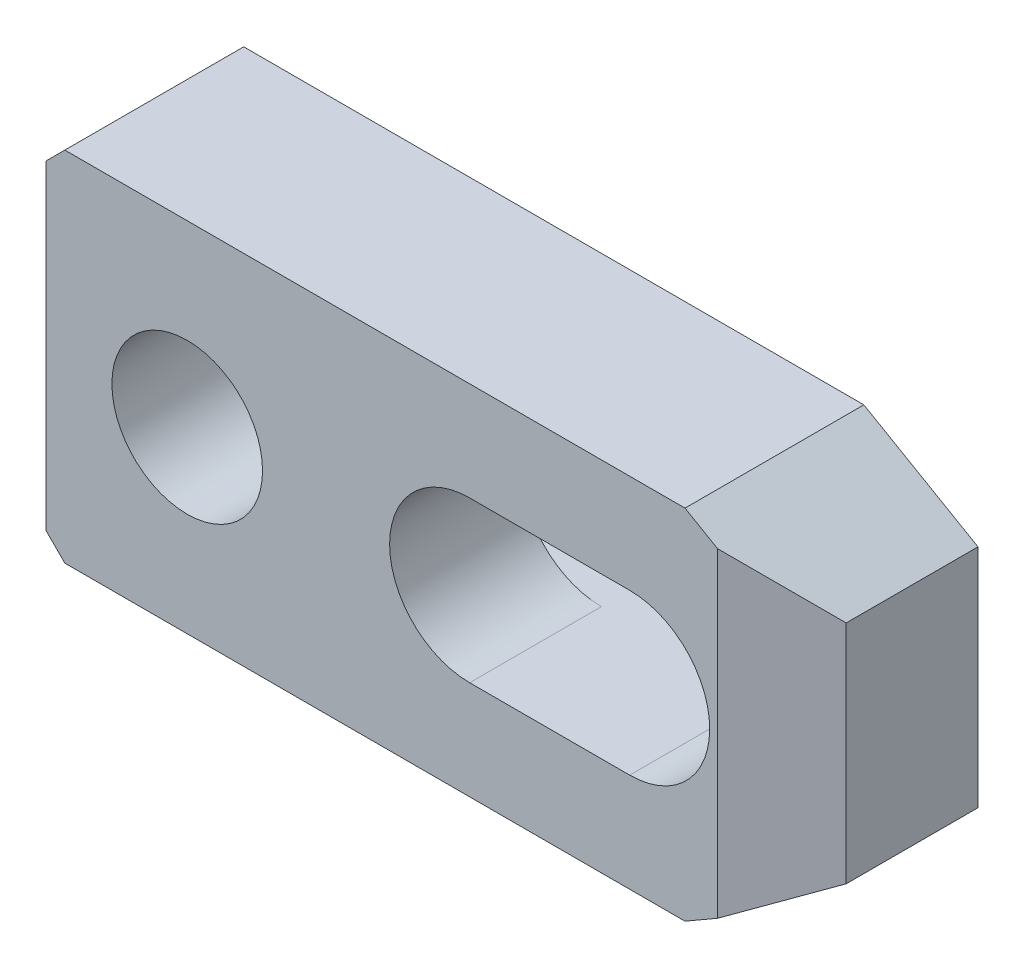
ISO-10303-21;
HEADER;
FILE_DESCRIPTION(('STEP AP214'),'2;1');
FILE_NAME('part.step','',(''),(''),'','','');
FILE_SCHEMA(('AUTOMOTIVE_DESIGN { 1 0 10303 214 1 1 1 1 }'));
ENDSEC;
DATA;
#1=APPLICATION_CONTEXT('core data for automotive mechanical design processes');
#2=APPLICATION_PROTOCOL_DEFINITION('international standard','automotive_design',2000,#1);
#3=PRODUCT_CONTEXT('',#1,'mechanical');
#4=PRODUCT('Part','Part','',(#3));
#5=PRODUCT_RELATED_PRODUCT_CATEGORY('part','',(#4));
#6=PRODUCT_DEFINITION_FORMATION('','',#4);
#7=PRODUCT_DEFINITION_CONTEXT('part definition',#1,'design');
#8=PRODUCT_DEFINITION('design','',#6,#7);
#9=PRODUCT_DEFINITION_SHAPE('','',#8);
#10=(LENGTH_UNIT() NAMED_UNIT(*) SI_UNIT(.MILLI.,.METRE.));
#11=(NAMED_UNIT(*) PLANE_ANGLE_UNIT() SI_UNIT($,.RADIAN.));
#12=(NAMED_UNIT(*) SI_UNIT($,.STERADIAN.) SOLID_ANGLE_UNIT());
#13=UNCERTAINTY_MEASURE_WITH_UNIT(LENGTH_MEASURE(1.E-05),#10,'distance_accuracy_value','');
#14=(GEOMETRIC_REPRESENTATION_CONTEXT(3) GLOBAL_UNCERTAINTY_ASSIGNED_CONTEXT((#13)) GLOBAL_UNIT_ASSIGNED_CONTEXT((#10,
#11,#12)) REPRESENTATION_CONTEXT('',''));
#15=CARTESIAN_POINT('',(0.,0.,0.));
#16=DIRECTION('',(0.,0.,1.));
#17=DIRECTION('',(1.,0.,0.));
#18=AXIS2_PLACEMENT_3D('',#15,#16,#17);
#19=CARTESIAN_POINT('',(-35.8878406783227,43.1121593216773,0.));
#20=DIRECTION('',(0.,0.,1.));
#21=DIRECTION('',(-1.,0.,0.));
#22=AXIS2_PLACEMENT_3D('',#19,#20,#21);
#23=PLANE('',#22);
#24=DIRECTION('',(0.,1.,0.));
#25=VECTOR('',#24,1.);
#26=CARTESIAN_POINT('',(-62.,-17.0000000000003,0.));
#27=LINE('',#26,#25);
#28=CARTESIAN_POINT('',(-62.,-17.0000000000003,0.));
#29=VERTEX_POINT('',#28);
#30=CARTESIAN_POINT('',(-62.,-8.50000000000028,0.));
#31=VERTEX_POINT('',#30);
#32=EDGE_CURVE('E147',#29,#31,#27,.T.);
#33=ORIENTED_EDGE('',*,*,#32,.T.);
#34=DIRECTION('',(-1.,0.,0.));
#35=VECTOR('',#34,1.);
#36=CARTESIAN_POINT('',(0.,-8.49999999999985,0.));
#37=LINE('',#36,#35);
#38=CARTESIAN_POINT('',(0.,-8.49999999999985,0.));
#39=VERTEX_POINT('',#38);
#40=EDGE_CURVE('E237',#39,#31,#37,.T.);
#41=ORIENTED_EDGE('',*,*,#40,.F.);
#42=CARTESIAN_POINT('',(0.,1.53625267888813E-13,0.));
#43=DIRECTION('',(0.,0.,1.));
#44=DIRECTION('',(-1.,0.,0.));
#45=AXIS2_PLACEMENT_3D('',#42,#43,#44);
#46=CIRCLE('',#45,8.5);
#47=CARTESIAN_POINT('',(0.,8.50000000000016,0.));
#48=VERTEX_POINT('',#47);
#49=EDGE_CURVE('E128',#39,#48,#46,.T.);
#50=ORIENTED_EDGE('',*,*,#49,.T.);
#51=DIRECTION('',(1.,0.,0.));
#52=VECTOR('',#51,1.);
#53=CARTESIAN_POINT('',(-17.,8.5,0.));
#54=LINE('',#53,#52);
#55=CARTESIAN_POINT('',(-62.,8.49999999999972,0.));
#56=VERTEX_POINT('',#55);
#57=EDGE_CURVE('E119',#56,#48,#54,.T.);
#58=ORIENTED_EDGE('',*,*,#57,.F.);
#59=CARTESIAN_POINT('',(-62.,16.9999999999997,0.));
#60=VERTEX_POINT('',#59);
#61=EDGE_CURVE('E124',#56,#60,#27,.T.);
#62=ORIENTED_EDGE('',*,*,#61,.T.);
#63=DIRECTION('',(-0.707106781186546,-0.70710678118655,0.));
#64=VECTOR('',#63,1.);
#65=CARTESIAN_POINT('',(-60.,18.9999999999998,0.));
#66=LINE('',#65,#64);
#67=CARTESIAN_POINT('',(-60.,18.9999999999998,0.));
#68=VERTEX_POINT('',#67);
#69=EDGE_CURVE('E148',#68,#60,#66,.T.);
#70=ORIENTED_EDGE('',*,*,#69,.F.);
#71=DIRECTION('',(-1.,0.,0.));
#72=VECTOR('',#71,1.);
#73=CARTESIAN_POINT('',(5.8756443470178,19.,0.));
#74=LINE('',#73,#72);
#75=CARTESIAN_POINT('',(5.8756443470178,19.,0.));
#76=VERTEX_POINT('',#75);
#77=EDGE_CURVE('E151',#76,#68,#74,.T.);
#78=ORIENTED_EDGE('',*,*,#77,.F.);
#79=DIRECTION('',(-0.866025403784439,0.499999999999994,0.));
#80=VECTOR('',#79,1.);
#81=CARTESIAN_POINT('',(18.,12.0000000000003,0.));
#82=LINE('',#81,#80);
#83=CARTESIAN_POINT('',(18.,12.0000000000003,0.));
#84=VERTEX_POINT('',#83);
#85=EDGE_CURVE('E158',#84,#76,#82,.T.);
#86=ORIENTED_EDGE('',*,*,#85,.F.);
#87=DIRECTION('',(0.,-1.,0.));
#88=VECTOR('',#87,1.);
#89=CARTESIAN_POINT('',(18.,12.0000000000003,0.));
#90=LINE('',#89,#88);
#91=CARTESIAN_POINT('',(18.,-11.9999999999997,0.));
#92=VERTEX_POINT('',#91);
#93=EDGE_CURVE('E181',#84,#92,#90,.T.);
#94=ORIENTED_EDGE('',*,*,#93,.T.);
#95=DIRECTION('',(-0.866025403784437,-0.500000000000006,0.));
#96=VECTOR('',#95,1.);
#97=CARTESIAN_POINT('',(18.,-11.9999999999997,0.));
#98=LINE('',#97,#96);
#99=CARTESIAN_POINT('',(5.87564434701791,-19.,0.));
#100=VERTEX_POINT('',#99);
#101=EDGE_CURVE('E208',#92,#100,#98,.T.);
#102=ORIENTED_EDGE('',*,*,#101,.T.);
#103=DIRECTION('',(-1.,0.,0.));
#104=VECTOR('',#103,1.);
#105=CARTESIAN_POINT('',(5.87564434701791,-19.,0.));
#106=LINE('',#105,#104);
#107=CARTESIAN_POINT('',(-60.,-19.0000000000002,0.));
#108=VERTEX_POINT('',#107);
#109=EDGE_CURVE('E210',#100,#108,#106,.T.);
#110=ORIENTED_EDGE('',*,*,#109,.T.);
#111=DIRECTION('',(-0.707106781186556,0.707106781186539,0.));
#112=VECTOR('',#111,1.);
#113=CARTESIAN_POINT('',(-60.,-19.0000000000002,0.));
#114=LINE('',#113,#112);
#115=EDGE_CURVE('E150',#108,#29,#114,.T.);
#116=ORIENTED_EDGE('',*,*,#115,.T.);
#117=EDGE_LOOP('',(#33,#41,#50,#58,#62,#70,#78,#86,#94,#102,#110,#116));
#118=FACE_BOUND('',#117,.T.);
#119=ADVANCED_FACE('F14',(#118),#23,.F.);
#120=CARTESIAN_POINT('',(-62.,-17.0000000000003,19.));
#121=DIRECTION('',(-1.,0.,0.));
#122=DIRECTION('',(0.,0.,-1.));
#123=AXIS2_PLACEMENT_3D('',#120,#121,#122);
#124=PLANE('',#123);
#125=DIRECTION('',(0.,-1.,0.));
#126=VECTOR('',#125,1.);
#127=CARTESIAN_POINT('',(-62.,-17.0000000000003,5.));
#128=LINE('',#127,#126);
#129=CARTESIAN_POINT('',(-62.,8.49999999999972,5.));
#130=VERTEX_POINT('',#129);
#131=CARTESIAN_POINT('',(-62.,-8.50000000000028,5.));
#132=VERTEX_POINT('',#131);
#133=EDGE_CURVE('E141',#130,#132,#128,.T.);
#134=ORIENTED_EDGE('',*,*,#133,.T.);
#135=DIRECTION('',(0.,0.,-1.));
#136=VECTOR('',#135,1.);
#137=CARTESIAN_POINT('',(-62.,-8.50000000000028,19.));
#138=LINE('',#137,#136);
#139=EDGE_CURVE('E140',#132,#31,#138,.T.);
#140=ORIENTED_EDGE('',*,*,#139,.T.);
#141=ORIENTED_EDGE('',*,*,#32,.F.);
#142=DIRECTION('',(0.,0.,-1.));
#143=VECTOR('',#142,1.);
#144=CARTESIAN_POINT('',(-62.,-17.0000000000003,19.));
#145=LINE('',#144,#143);
#146=CARTESIAN_POINT('',(-62.,-17.0000000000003,19.));
#147=VERTEX_POINT('',#146);
#148=EDGE_CURVE('E189',#147,#29,#145,.T.);
#149=ORIENTED_EDGE('',*,*,#148,.F.);
#150=DIRECTION('',(0.,1.,0.));
#151=VECTOR('',#150,1.);
#152=CARTESIAN_POINT('',(-62.,-17.0000000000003,19.));
#153=LINE('',#152,#151);
#154=CARTESIAN_POINT('',(-62.,16.9999999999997,19.));
#155=VERTEX_POINT('',#154);
#156=EDGE_CURVE('E171',#147,#155,#153,.T.);
#157=ORIENTED_EDGE('',*,*,#156,.T.);
#158=DIRECTION('',(0.,0.,-1.));
#159=VECTOR('',#158,1.);
#160=CARTESIAN_POINT('',(-62.,16.9999999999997,19.));
#161=LINE('',#160,#159);
#162=EDGE_CURVE('E145',#155,#60,#161,.T.);
#163=ORIENTED_EDGE('',*,*,#162,.T.);
#164=ORIENTED_EDGE('',*,*,#61,.F.);
#165=DIRECTION('',(0.,0.,-1.));
#166=VECTOR('',#165,1.);
#167=CARTESIAN_POINT('',(-62.,8.49999999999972,19.));
#168=LINE('',#167,#166);
#169=EDGE_CURVE('E135',#130,#56,#168,.T.);
#170=ORIENTED_EDGE('',*,*,#169,.F.);
#171=EDGE_LOOP('',(#134,#140,#141,#149,#157,#163,#164,#170));
#172=FACE_BOUND('',#171,.T.);
#173=ADVANCED_FACE('F143',(#172),#124,.T.);
#174=CARTESIAN_POINT('',(-47.,-1.68451949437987E-13,19.));
#175=DIRECTION('',(0.,0.,-1.));
#176=DIRECTION('',(1.,0.,0.));
#177=AXIS2_PLACEMENT_3D('',#174,#175,#176);
#178=CYLINDRICAL_SURFACE('',#177,8.);
#179=CARTESIAN_POINT('',(-47.,-1.68451949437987E-13,19.));
#180=DIRECTION('',(0.,0.,1.));
#181=DIRECTION('',(-1.,0.,0.));
#182=AXIS2_PLACEMENT_3D('',#179,#180,#181);
#183=CIRCLE('',#182,8.);
#184=CARTESIAN_POINT('',(-55.,-2.24315683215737E-13,19.));
#185=VERTEX_POINT('',#184);
#186=EDGE_CURVE('E161',#185,#185,#183,.T.);
#187=ORIENTED_EDGE('',*,*,#186,.T.);
#188=EDGE_LOOP('',(#187));
#189=FACE_BOUND('',#188,.T.);
#190=CARTESIAN_POINT('',(-47.,-1.68451949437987E-13,5.));
#191=DIRECTION('',(0.,0.,-1.));
#192=DIRECTION('',(1.,0.,0.));
#193=AXIS2_PLACEMENT_3D('',#190,#191,#192);
#194=CIRCLE('',#193,8.);
#195=CARTESIAN_POINT('',(-39.,-1.12588215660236E-13,5.));
#196=VERTEX_POINT('',#195);
#197=EDGE_CURVE('E400',#196,#196,#194,.T.);
#198=ORIENTED_EDGE('',*,*,#197,.T.);
#199=EDGE_LOOP('',(#198));
#200=FACE_BOUND('',#199,.T.);
#201=ADVANCED_FACE('F262',(#189,#200),#178,.F.);
#202=CARTESIAN_POINT('',(-17.,0.,19.));
#203=DIRECTION('',(0.,0.,-1.));
#204=DIRECTION('',(1.,0.,0.));
#205=AXIS2_PLACEMENT_3D('',#202,#203,#204);
#206=CYLINDRICAL_SURFACE('',#205,8.5);
#207=DIRECTION('',(0.,0.,-1.));
#208=VECTOR('',#207,1.);
#209=CARTESIAN_POINT('',(-17.,-8.5,19.));
#210=LINE('',#209,#208);
#211=CARTESIAN_POINT('',(-17.,-8.5,19.));
#212=VERTEX_POINT('',#211);
#213=CARTESIAN_POINT('',(-17.,-8.5,5.));
#214=VERTEX_POINT('',#213);
#215=EDGE_CURVE('E256',#212,#214,#210,.T.);
#216=ORIENTED_EDGE('',*,*,#215,.T.);
#217=CARTESIAN_POINT('',(-17.,0.,5.));
#218=DIRECTION('',(0.,0.,-1.));
#219=DIRECTION('',(1.,0.,0.));
#220=AXIS2_PLACEMENT_3D('',#217,#218,#219);
#221=CIRCLE('',#220,8.5);
#222=CARTESIAN_POINT('',(-17.,8.5,5.));
#223=VERTEX_POINT('',#222);
#224=EDGE_CURVE('E278',#214,#223,#221,.T.);
#225=ORIENTED_EDGE('',*,*,#224,.T.);
#226=DIRECTION('',(0.,0.,-1.));
#227=VECTOR('',#226,1.);
#228=CARTESIAN_POINT('',(-17.,8.5,19.));
#229=LINE('',#228,#227);
#230=CARTESIAN_POINT('',(-17.,8.5,19.));
#231=VERTEX_POINT('',#230);
#232=EDGE_CURVE('E244',#231,#223,#229,.T.);
#233=ORIENTED_EDGE('',*,*,#232,.F.);
#234=CARTESIAN_POINT('',(-17.,0.,19.));
#235=DIRECTION('',(0.,0.,1.));
#236=DIRECTION('',(-1.,0.,0.));
#237=AXIS2_PLACEMENT_3D('',#234,#235,#236);
#238=CIRCLE('',#237,8.5);
#239=EDGE_CURVE('E132',#231,#212,#238,.T.);
#240=ORIENTED_EDGE('',*,*,#239,.T.);
#241=EDGE_LOOP('',(#216,#225,#233,#240));
#242=FACE_BOUND('',#241,.T.);
#243=ADVANCED_FACE('F269',(#242),#206,.F.);
#244=CARTESIAN_POINT('',(-35.8878406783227,43.1121593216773,19.));
#245=DIRECTION('',(0.,0.,1.));
#246=DIRECTION('',(-1.,0.,0.));
#247=AXIS2_PLACEMENT_3D('',#244,#245,#246);
#248=PLANE('',#247);
#249=DIRECTION('',(0.,-1.,0.));
#250=VECTOR('',#249,1.);
#251=CARTESIAN_POINT('',(9.3397459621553,43.1121593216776,19.));
#252=LINE('',#251,#250);
#253=CARTESIAN_POINT('',(9.3397459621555,17.,19.));
#254=VERTEX_POINT('',#253);
#255=CARTESIAN_POINT('',(9.3397459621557,-17.,19.));
#256=VERTEX_POINT('',#255);
#257=EDGE_CURVE('E233',#254,#256,#252,.T.);
#258=ORIENTED_EDGE('',*,*,#257,.F.);
#259=DIRECTION('',(-0.866025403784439,0.499999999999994,0.));
#260=VECTOR('',#259,1.);
#261=CARTESIAN_POINT('',(18.,12.0000000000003,19.));
#262=LINE('',#261,#260);
#263=CARTESIAN_POINT('',(5.8756443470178,19.,19.));
#264=VERTEX_POINT('',#263);
#265=EDGE_CURVE('E179',#254,#264,#262,.T.);
#266=ORIENTED_EDGE('',*,*,#265,.T.);
#267=DIRECTION('',(-1.,0.,0.));
#268=VECTOR('',#267,1.);
#269=CARTESIAN_POINT('',(5.8756443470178,19.,19.));
#270=LINE('',#269,#268);
#271=CARTESIAN_POINT('',(-60.,18.9999999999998,19.));
#272=VERTEX_POINT('',#271);
#273=EDGE_CURVE('E176',#264,#272,#270,.T.);
#274=ORIENTED_EDGE('',*,*,#273,.T.);
#275=DIRECTION('',(-0.707106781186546,-0.70710678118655,0.));
#276=VECTOR('',#275,1.);
#277=CARTESIAN_POINT('',(-60.,18.9999999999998,19.));
#278=LINE('',#277,#276);
#279=EDGE_CURVE('E173',#272,#155,#278,.T.);
#280=ORIENTED_EDGE('',*,*,#279,.T.);
#281=ORIENTED_EDGE('',*,*,#156,.F.);
#282=DIRECTION('',(-0.707106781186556,0.707106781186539,0.));
#283=VECTOR('',#282,1.);
#284=CARTESIAN_POINT('',(-60.,-19.0000000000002,19.));
#285=LINE('',#284,#283);
#286=CARTESIAN_POINT('',(-60.,-19.0000000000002,19.));
#287=VERTEX_POINT('',#286);
#288=EDGE_CURVE('E168',#287,#147,#285,.T.);
#289=ORIENTED_EDGE('',*,*,#288,.F.);
#290=DIRECTION('',(-1.,0.,0.));
#291=VECTOR('',#290,1.);
#292=CARTESIAN_POINT('',(5.87564434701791,-19.,19.));
#293=LINE('',#292,#291);
#294=CARTESIAN_POINT('',(5.87564434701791,-19.,19.));
#295=VERTEX_POINT('',#294);
#296=EDGE_CURVE('E165',#295,#287,#293,.T.);
#297=ORIENTED_EDGE('',*,*,#296,.F.);
#298=DIRECTION('',(-0.866025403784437,-0.500000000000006,0.));
#299=VECTOR('',#298,1.);
#300=CARTESIAN_POINT('',(18.,-11.9999999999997,19.));
#301=LINE('',#300,#299);
#302=EDGE_CURVE('E162',#256,#295,#301,.T.);
#303=ORIENTED_EDGE('',*,*,#302,.F.);
#304=EDGE_LOOP('',(#258,#266,#274,#280,#281,#289,#297,#303));
#305=FACE_BOUND('',#304,.T.);
#306=ORIENTED_EDGE('',*,*,#186,.F.);
#307=EDGE_LOOP('',(#306));
#308=FACE_BOUND('',#307,.T.);
#309=DIRECTION('',(-1.,0.,0.));
#310=VECTOR('',#309,1.);
#311=CARTESIAN_POINT('',(0.,-8.49999999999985,19.));
#312=LINE('',#311,#310);
#313=CARTESIAN_POINT('',(0.,-8.49999999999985,19.));
#314=VERTEX_POINT('',#313);
#315=EDGE_CURVE('E247',#314,#212,#312,.T.);
#316=ORIENTED_EDGE('',*,*,#315,.T.);
#317=ORIENTED_EDGE('',*,*,#239,.F.);
#318=DIRECTION('',(1.,0.,0.));
#319=VECTOR('',#318,1.);
#320=CARTESIAN_POINT('',(-17.,8.5,19.));
#321=LINE('',#320,#319);
#322=CARTESIAN_POINT('',(0.,8.50000000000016,19.));
#323=VERTEX_POINT('',#322);
#324=EDGE_CURVE('E241',#231,#323,#321,.T.);
#325=ORIENTED_EDGE('',*,*,#324,.T.);
#326=CARTESIAN_POINT('',(0.,1.53625267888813E-13,19.));
#327=DIRECTION('',(0.,0.,1.));
#328=DIRECTION('',(-1.,0.,0.));
#329=AXIS2_PLACEMENT_3D('',#326,#327,#328);
#330=CIRCLE('',#329,8.5);
#331=EDGE_CURVE('E245',#314,#323,#330,.T.);
#332=ORIENTED_EDGE('',*,*,#331,.F.);
#333=EDGE_LOOP('',(#316,#317,#325,#332));
#334=FACE_BOUND('',#333,.T.);
#335=ADVANCED_FACE('F265',(#305,#308,#334),#248,.T.);
#336=CARTESIAN_POINT('',(18.,12.0000000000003,19.));
#337=DIRECTION('',(-0.499999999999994,-0.866025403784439,0.));
#338=DIRECTION('',(0.86602540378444,-0.499999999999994,0.));
#339=AXIS2_PLACEMENT_3D('',#336,#337,#338);
#340=PLANE('',#339);
#341=ORIENTED_EDGE('',*,*,#265,.F.);
#342=DIRECTION('',(0.774596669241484,-0.447213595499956,-0.447213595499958));
#343=VECTOR('',#342,1.);
#344=CARTESIAN_POINT('',(16.267949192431,13.0000000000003,15.));
#345=LINE('',#344,#343);
#346=CARTESIAN_POINT('',(18.,12.0000000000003,14.));
#347=VERTEX_POINT('',#346);
#348=EDGE_CURVE('E235',#254,#347,#345,.T.);
#349=ORIENTED_EDGE('',*,*,#348,.T.);
#350=DIRECTION('',(0.,0.,-1.));
#351=VECTOR('',#350,1.);
#352=CARTESIAN_POINT('',(18.,12.0000000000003,19.));
#353=LINE('',#352,#351);
#354=EDGE_CURVE('E164',#347,#84,#353,.T.);
#355=ORIENTED_EDGE('',*,*,#354,.T.);
#356=ORIENTED_EDGE('',*,*,#85,.T.);
#357=DIRECTION('',(0.,0.,-1.));
#358=VECTOR('',#357,1.);
#359=CARTESIAN_POINT('',(5.8756443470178,19.,19.));
#360=LINE('',#359,#358);
#361=EDGE_CURVE('E9',#264,#76,#360,.T.);
#362=ORIENTED_EDGE('',*,*,#361,.F.);
#363=EDGE_LOOP('',(#341,#349,#355,#356,#362));
#364=FACE_BOUND('',#363,.T.);
#365=ADVANCED_FACE('F268',(#364),#340,.F.);
#366=CARTESIAN_POINT('',(5.8756443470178,19.,19.));
#367=DIRECTION('',(0.,-1.,0.));
#368=DIRECTION('',(0.,0.,1.));
#369=AXIS2_PLACEMENT_3D('',#366,#367,#368);
#370=PLANE('',#369);
#371=DIRECTION('',(0.,0.,-1.));
#372=VECTOR('',#371,1.);
#373=CARTESIAN_POINT('',(-60.,18.9999999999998,19.));
#374=LINE('',#373,#372);
#375=EDGE_CURVE('E22',#272,#68,#374,.T.);
#376=ORIENTED_EDGE('',*,*,#375,.F.);
#377=ORIENTED_EDGE('',*,*,#273,.F.);
#378=ORIENTED_EDGE('',*,*,#361,.T.);
#379=ORIENTED_EDGE('',*,*,#77,.T.);
#380=EDGE_LOOP('',(#376,#377,#378,#379));
#381=FACE_BOUND('',#380,.T.);
#382=ADVANCED_FACE('F16',(#381),#370,.F.);
#383=CARTESIAN_POINT('',(-60.,18.9999999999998,19.));
#384=DIRECTION('',(0.70710678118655,-0.707106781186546,0.));
#385=DIRECTION('',(0.707106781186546,0.70710678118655,0.));
#386=AXIS2_PLACEMENT_3D('',#383,#384,#385);
#387=PLANE('',#386);
#388=ORIENTED_EDGE('',*,*,#162,.F.);
#389=ORIENTED_EDGE('',*,*,#279,.F.);
#390=ORIENTED_EDGE('',*,*,#375,.T.);
#391=ORIENTED_EDGE('',*,*,#69,.T.);
#392=EDGE_LOOP('',(#388,#389,#390,#391));
#393=FACE_BOUND('',#392,.T.);
#394=ADVANCED_FACE('F193',(#393),#387,.F.);
#395=CARTESIAN_POINT('',(-60.,-19.0000000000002,19.));
#396=DIRECTION('',(-0.707106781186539,-0.707106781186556,0.));
#397=DIRECTION('',(0.707106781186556,-0.707106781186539,0.));
#398=AXIS2_PLACEMENT_3D('',#395,#396,#397);
#399=PLANE('',#398);
#400=DIRECTION('',(0.,0.,-1.));
#401=VECTOR('',#400,1.);
#402=CARTESIAN_POINT('',(-60.,-19.0000000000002,19.));
#403=LINE('',#402,#401);
#404=EDGE_CURVE('E187',#287,#108,#403,.T.);
#405=ORIENTED_EDGE('',*,*,#404,.F.);
#406=ORIENTED_EDGE('',*,*,#288,.T.);
#407=ORIENTED_EDGE('',*,*,#148,.T.);
#408=ORIENTED_EDGE('',*,*,#115,.F.);
#409=EDGE_LOOP('',(#405,#406,#407,#408));
#410=FACE_BOUND('',#409,.T.);
#411=ADVANCED_FACE('F220',(#410),#399,.T.);
#412=CARTESIAN_POINT('',(5.87564434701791,-19.,19.));
#413=DIRECTION('',(0.,-1.,0.));
#414=DIRECTION('',(0.,0.,1.));
#415=AXIS2_PLACEMENT_3D('',#412,#413,#414);
#416=PLANE('',#415);
#417=DIRECTION('',(0.,0.,-1.));
#418=VECTOR('',#417,1.);
#419=CARTESIAN_POINT('',(5.87564434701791,-19.,19.));
#420=LINE('',#419,#418);
#421=EDGE_CURVE('E185',#295,#100,#420,.T.);
#422=ORIENTED_EDGE('',*,*,#421,.F.);
#423=ORIENTED_EDGE('',*,*,#296,.T.);
#424=ORIENTED_EDGE('',*,*,#404,.T.);
#425=ORIENTED_EDGE('',*,*,#109,.F.);
#426=EDGE_LOOP('',(#422,#423,#424,#425));
#427=FACE_BOUND('',#426,.T.);
#428=ADVANCED_FACE('F308',(#427),#416,.T.);
#429=CARTESIAN_POINT('',(18.,-11.9999999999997,19.));
#430=DIRECTION('',(0.500000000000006,-0.866025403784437,0.));
#431=DIRECTION('',(0.866025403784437,0.500000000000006,0.));
#432=AXIS2_PLACEMENT_3D('',#429,#430,#431);
#433=PLANE('',#432);
#434=DIRECTION('',(0.774596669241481,0.447213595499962,-0.44721359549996));
#435=VECTOR('',#434,1.);
#436=CARTESIAN_POINT('',(16.2679491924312,-12.9999999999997,15.));
#437=LINE('',#436,#435);
#438=CARTESIAN_POINT('',(18.,-11.9999999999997,14.));
#439=VERTEX_POINT('',#438);
#440=EDGE_CURVE('E37',#256,#439,#437,.T.);
#441=ORIENTED_EDGE('',*,*,#440,.F.);
#442=ORIENTED_EDGE('',*,*,#302,.T.);
#443=ORIENTED_EDGE('',*,*,#421,.T.);
#444=ORIENTED_EDGE('',*,*,#101,.F.);
#445=DIRECTION('',(0.,0.,-1.));
#446=VECTOR('',#445,1.);
#447=CARTESIAN_POINT('',(18.,-11.9999999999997,19.));
#448=LINE('',#447,#446);
#449=EDGE_CURVE('E183',#439,#92,#448,.T.);
#450=ORIENTED_EDGE('',*,*,#449,.F.);
#451=EDGE_LOOP('',(#441,#442,#443,#444,#450));
#452=FACE_BOUND('',#451,.T.);
#453=ADVANCED_FACE('F305',(#452),#433,.T.);
#454=CARTESIAN_POINT('',(18.,12.0000000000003,19.));
#455=DIRECTION('',(1.,0.,0.));
#456=DIRECTION('',(0.,0.,1.));
#457=AXIS2_PLACEMENT_3D('',#454,#455,#456);
#458=PLANE('',#457);
#459=DIRECTION('',(0.,-1.,0.));
#460=VECTOR('',#459,1.);
#461=CARTESIAN_POINT('',(18.,20.0000000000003,14.));
#462=LINE('',#461,#460);
#463=EDGE_CURVE('E227',#347,#439,#462,.T.);
#464=ORIENTED_EDGE('',*,*,#463,.T.);
#465=ORIENTED_EDGE('',*,*,#449,.T.);
#466=ORIENTED_EDGE('',*,*,#93,.F.);
#467=ORIENTED_EDGE('',*,*,#354,.F.);
#468=EDGE_LOOP('',(#464,#465,#466,#467));
#469=FACE_BOUND('',#468,.T.);
#470=ADVANCED_FACE('F205',(#469),#458,.T.);
#471=CARTESIAN_POINT('',(0.,-8.49999999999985,19.));
#472=DIRECTION('',(0.,-1.,0.));
#473=DIRECTION('',(0.,0.,1.));
#474=AXIS2_PLACEMENT_3D('',#471,#472,#473);
#475=PLANE('',#474);
#476=ORIENTED_EDGE('',*,*,#40,.T.);
#477=ORIENTED_EDGE('',*,*,#139,.F.);
#478=DIRECTION('',(1.,0.,0.));
#479=VECTOR('',#478,1.);
#480=CARTESIAN_POINT('',(-72.,-8.50000000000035,5.));
#481=LINE('',#480,#479);
#482=EDGE_CURVE('E276',#132,#214,#481,.T.);
#483=ORIENTED_EDGE('',*,*,#482,.T.);
#484=ORIENTED_EDGE('',*,*,#215,.F.);
#485=ORIENTED_EDGE('',*,*,#315,.F.);
#486=DIRECTION('',(0.,0.,-1.));
#487=VECTOR('',#486,1.);
#488=CARTESIAN_POINT('',(0.,-8.49999999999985,19.));
#489=LINE('',#488,#487);
#490=EDGE_CURVE('E255',#314,#39,#489,.T.);
#491=ORIENTED_EDGE('',*,*,#490,.T.);
#492=EDGE_LOOP('',(#476,#477,#483,#484,#485,#491));
#493=FACE_BOUND('',#492,.T.);
#494=ADVANCED_FACE('F275',(#493),#475,.F.);
#495=CARTESIAN_POINT('',(0.,1.53625267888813E-13,19.));
#496=DIRECTION('',(0.,0.,-1.));
#497=DIRECTION('',(1.,0.,0.));
#498=AXIS2_PLACEMENT_3D('',#495,#496,#497);
#499=CYLINDRICAL_SURFACE('',#498,8.5);
#500=DIRECTION('',(0.,0.,-1.));
#501=VECTOR('',#500,1.);
#502=CARTESIAN_POINT('',(0.,8.50000000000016,19.));
#503=LINE('',#502,#501);
#504=EDGE_CURVE('E253',#323,#48,#503,.T.);
#505=ORIENTED_EDGE('',*,*,#504,.T.);
#506=ORIENTED_EDGE('',*,*,#49,.F.);
#507=ORIENTED_EDGE('',*,*,#490,.F.);
#508=ORIENTED_EDGE('',*,*,#331,.T.);
#509=EDGE_LOOP('',(#505,#506,#507,#508));
#510=FACE_BOUND('',#509,.T.);
#511=ADVANCED_FACE('F280',(#510),#499,.F.);
#512=CARTESIAN_POINT('',(-17.,8.5,19.));
#513=DIRECTION('',(0.,1.,0.));
#514=DIRECTION('',(-1.,0.,0.));
#515=AXIS2_PLACEMENT_3D('',#512,#513,#514);
#516=PLANE('',#515);
#517=ORIENTED_EDGE('',*,*,#57,.T.);
#518=ORIENTED_EDGE('',*,*,#504,.F.);
#519=ORIENTED_EDGE('',*,*,#324,.F.);
#520=ORIENTED_EDGE('',*,*,#232,.T.);
#521=DIRECTION('',(1.,0.,0.));
#522=VECTOR('',#521,1.);
#523=CARTESIAN_POINT('',(-72.,8.49999999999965,5.));
#524=LINE('',#523,#522);
#525=EDGE_CURVE('E29',#130,#223,#524,.T.);
#526=ORIENTED_EDGE('',*,*,#525,.F.);
#527=ORIENTED_EDGE('',*,*,#169,.T.);
#528=EDGE_LOOP('',(#517,#518,#519,#520,#526,#527));
#529=FACE_BOUND('',#528,.T.);
#530=ADVANCED_FACE('F136',(#529),#516,.F.);
#531=CARTESIAN_POINT('',(5.87564434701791,20.,21.));
#532=DIRECTION('',(-0.5,0.,-0.866025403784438));
#533=DIRECTION('',(0.866025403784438,0.,-0.5));
#534=AXIS2_PLACEMENT_3D('',#531,#532,#533);
#535=PLANE('',#534);
#536=ORIENTED_EDGE('',*,*,#257,.T.);
#537=ORIENTED_EDGE('',*,*,#440,.T.);
#538=ORIENTED_EDGE('',*,*,#463,.F.);
#539=ORIENTED_EDGE('',*,*,#348,.F.);
#540=EDGE_LOOP('',(#536,#537,#538,#539));
#541=FACE_BOUND('',#540,.T.);
#542=ADVANCED_FACE('F289',(#541),#535,.F.);
#543=CARTESIAN_POINT('',(-72.,-8.50000000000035,5.));
#544=DIRECTION('',(0.,0.,-1.));
#545=DIRECTION('',(1.,0.,0.));
#546=AXIS2_PLACEMENT_3D('',#543,#544,#545);
#547=PLANE('',#546);
#548=ORIENTED_EDGE('',*,*,#197,.F.);
#549=EDGE_LOOP('',(#548));
#550=FACE_BOUND('',#549,.T.);
#551=ORIENTED_EDGE('',*,*,#525,.T.);
#552=ORIENTED_EDGE('',*,*,#224,.F.);
#553=ORIENTED_EDGE('',*,*,#482,.F.);
#554=ORIENTED_EDGE('',*,*,#133,.F.);
#555=EDGE_LOOP('',(#551,#552,#553,#554));
#556=FACE_BOUND('',#555,.T.);
#557=ADVANCED_FACE('F386',(#550,#556),#547,.T.);
#558=CLOSED_SHELL('',(#119,#173,#201,#243,#335,#365,#382,#394,#411,#428,#453,#470,#494,#511,
#530,#542,#557));
#559=MANIFOLD_SOLID_BREP('B1',#558);
#560=ADVANCED_BREP_SHAPE_REPRESENTATION('',(#18,#559),#14);
#561=SHAPE_DEFINITION_REPRESENTATION(#9,#560);
ENDSEC;
END-ISO-10303-21;
